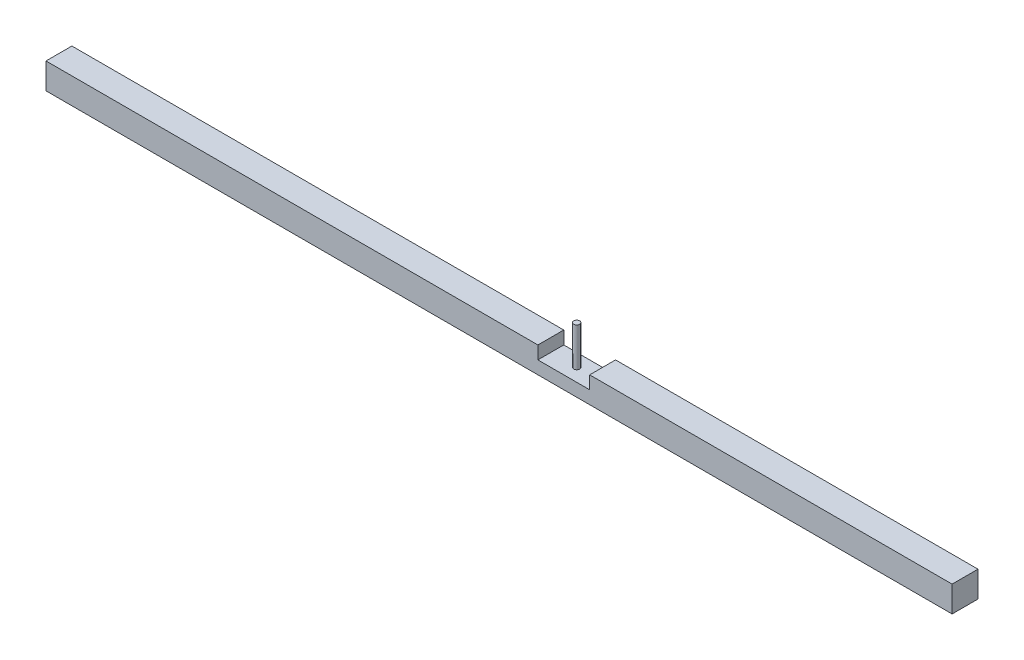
from build123d import *

# Parameters (mm, degrees)
EXTRUDE1_DEPTH      = 381
EXTRUDE1_DEPTH_BACK = 508
SKETCH1_W           = 25.4
SKETCH1_H           = 25.4
SKETCH2_W           = 12.7
SKETCH2_H           = 50.8
CUT_EXTRUDE1_DEPTH  = 12.7
SKETCH3_R           = 2.921
EXTRUDE2_DEPTH      = 38.1


with BuildPart() as part:
    # Sketch1 → Extrude1 (new, two sides: drawn at the far end of the back side and taken through both)
    with BuildSketch(Plane(origin=(0, 0, 0), x_dir=(0, -1, 0), z_dir=(1, 0, 0)).offset(-EXTRUDE1_DEPTH_BACK)):
        Rectangle(SKETCH1_W, SKETCH1_H)
    extrude(amount=EXTRUDE1_DEPTH + EXTRUDE1_DEPTH_BACK)

    # Sketch2 → Cut-Extrude1 (cut, symmetric)
    with BuildSketch(Plane(origin=(0, 0, 0), x_dir=(0, -1, 0), z_dir=(0, 0, 1))):
        with Locations((-6.35, 0)):
            Rectangle(SKETCH2_W, SKETCH2_H)
    extrude(amount=CUT_EXTRUDE1_DEPTH, both=True, mode=Mode.SUBTRACT)

    # Sketch3 → Extrude2 (add)
    with BuildSketch(Plane(origin=(0, 0, 0), x_dir=(-1, 0, 0), z_dir=(0, 1, 0))):
        with Locations(Location((0, 0, 0), (0, 0, 270))):
            Circle(SKETCH3_R)
    extrude(amount=EXTRUDE2_DEPTH)


solid = part.part
